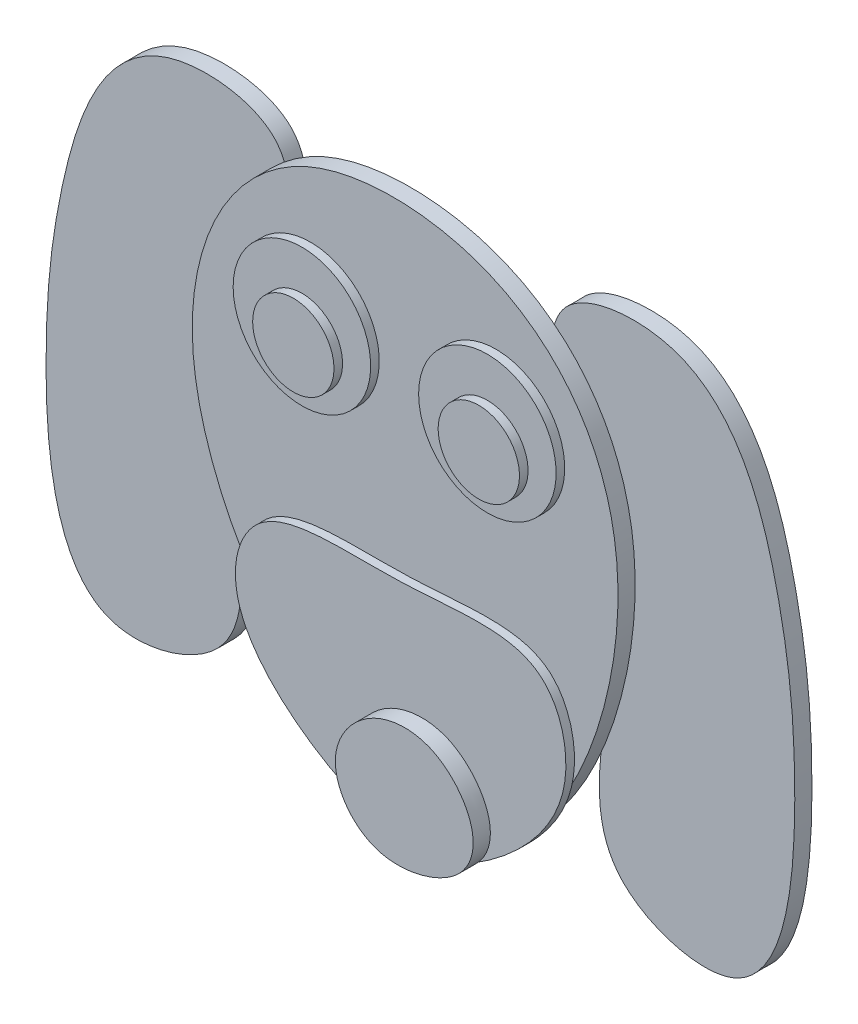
ISO-10303-21;
HEADER;
FILE_DESCRIPTION(('STEP AP214'),'2;1');
FILE_NAME('part.step','',(''),(''),'','','');
FILE_SCHEMA(('AUTOMOTIVE_DESIGN { 1 0 10303 214 1 1 1 1 }'));
ENDSEC;
DATA;
#1=APPLICATION_CONTEXT('core data for automotive mechanical design processes');
#2=APPLICATION_PROTOCOL_DEFINITION('international standard','automotive_design',2000,#1);
#3=PRODUCT_CONTEXT('',#1,'mechanical');
#4=PRODUCT('Part','Part','',(#3));
#5=PRODUCT_RELATED_PRODUCT_CATEGORY('part','',(#4));
#6=PRODUCT_DEFINITION_FORMATION('','',#4);
#7=PRODUCT_DEFINITION_CONTEXT('part definition',#1,'design');
#8=PRODUCT_DEFINITION('design','',#6,#7);
#9=PRODUCT_DEFINITION_SHAPE('','',#8);
#10=(LENGTH_UNIT() NAMED_UNIT(*) SI_UNIT(.MILLI.,.METRE.));
#11=(NAMED_UNIT(*) PLANE_ANGLE_UNIT() SI_UNIT($,.RADIAN.));
#12=(NAMED_UNIT(*) SI_UNIT($,.STERADIAN.) SOLID_ANGLE_UNIT());
#13=UNCERTAINTY_MEASURE_WITH_UNIT(LENGTH_MEASURE(1.E-05),#10,'distance_accuracy_value','');
#14=(GEOMETRIC_REPRESENTATION_CONTEXT(3) GLOBAL_UNCERTAINTY_ASSIGNED_CONTEXT((#13)) GLOBAL_UNIT_ASSIGNED_CONTEXT((#10,
#11,#12)) REPRESENTATION_CONTEXT('',''));
#15=CARTESIAN_POINT('',(0.,0.,0.));
#16=DIRECTION('',(0.,0.,1.));
#17=DIRECTION('',(1.,0.,0.));
#18=AXIS2_PLACEMENT_3D('',#15,#16,#17);
#19=CARTESIAN_POINT('',(9.45131541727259,-39.2016660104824,11.1125));
#20=CARTESIAN_POINT('',(6.01825131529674,-37.8422187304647,11.1125));
#21=CARTESIAN_POINT('',(-2.3819127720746,-38.5803454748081,11.1125));
#22=CARTESIAN_POINT('',(-10.8239151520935,-50.3911620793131,11.1125));
#23=CARTESIAN_POINT('',(-1.64758403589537,-63.4043750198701,11.1125));
#24=CARTESIAN_POINT('',(16.7982250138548,-58.7089776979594,11.1125));
#25=CARTESIAN_POINT('',(19.3055330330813,-47.5745492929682,11.1125));
#26=CARTESIAN_POINT('',(12.8395297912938,-40.5433534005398,11.1125));
#27=CARTESIAN_POINT('',(9.45131541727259,-39.2016660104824,11.1125));
#28=B_SPLINE_CURVE_WITH_KNOTS('',3,(#19,#20,#21,#22,#23,#24,#25,#26,#27),.UNSPECIFIED.,.T.,.F.,
(4,1,1,1,1,1,4),(0.,0.147508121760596,0.304736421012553,0.494752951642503,0.660366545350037,
0.85441893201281,1.),.UNSPECIFIED.);
#29=DIRECTION('',(0.,0.,-1.));
#30=VECTOR('',#29,1.);
#31=SURFACE_OF_LINEAR_EXTRUSION('',#28,#30);
#32=CARTESIAN_POINT('',(9.45131541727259,-39.2016660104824,11.1125));
#33=VERTEX_POINT('',#32);
#34=EDGE_CURVE('E11',#33,#33,#28,.T.);
#35=ORIENTED_EDGE('',*,*,#34,.F.);
#36=EDGE_LOOP('',(#35));
#37=FACE_BOUND('',#36,.T.);
#38=CARTESIAN_POINT('',(9.45131541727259,-39.2016660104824,7.9375));
#39=CARTESIAN_POINT('',(6.01825131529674,-37.8422187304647,7.9375));
#40=CARTESIAN_POINT('',(-2.3819127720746,-38.5803454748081,7.9375));
#41=CARTESIAN_POINT('',(-10.8239151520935,-50.3911620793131,7.9375));
#42=CARTESIAN_POINT('',(-1.64758403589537,-63.4043750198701,7.9375));
#43=CARTESIAN_POINT('',(16.7982250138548,-58.7089776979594,7.9375));
#44=CARTESIAN_POINT('',(19.3055330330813,-47.5745492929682,7.9375));
#45=CARTESIAN_POINT('',(12.8395297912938,-40.5433534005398,7.9375));
#46=CARTESIAN_POINT('',(9.45131541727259,-39.2016660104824,7.9375));
#47=B_SPLINE_CURVE_WITH_KNOTS('',3,(#38,#39,#40,#41,#42,#43,#44,#45,#46),.UNSPECIFIED.,.T.,.F.,
(4,1,1,1,1,1,4),(0.,0.147508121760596,0.304736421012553,0.494752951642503,0.660366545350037,
0.85441893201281,1.),.UNSPECIFIED.);
#48=CARTESIAN_POINT('',(9.45131541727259,-39.2016660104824,7.9375));
#49=VERTEX_POINT('',#48);
#50=EDGE_CURVE('E50',#49,#49,#47,.T.);
#51=ORIENTED_EDGE('',*,*,#50,.T.);
#52=EDGE_LOOP('',(#51));
#53=FACE_BOUND('',#52,.T.);
#54=ADVANCED_FACE('F46',(#37,#53),#31,.F.);
#55=CARTESIAN_POINT('',(0.796373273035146,-60.686504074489,11.1125));
#56=DIRECTION('',(0.,0.,-1.));
#57=DIRECTION('',(-1.,0.,0.));
#58=AXIS2_PLACEMENT_3D('',#55,#56,#57);
#59=PLANE('',#58);
#60=ORIENTED_EDGE('',*,*,#34,.T.);
#61=EDGE_LOOP('',(#60));
#62=FACE_BOUND('',#61,.T.);
#63=ADVANCED_FACE('F69',(#62),#59,.F.);
#64=CARTESIAN_POINT('',(0.796373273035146,-60.686504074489,7.9375));
#65=DIRECTION('',(0.,0.,-1.));
#66=DIRECTION('',(-1.,0.,0.));
#67=AXIS2_PLACEMENT_3D('',#64,#65,#66);
#68=PLANE('',#67);
#69=ORIENTED_EDGE('',*,*,#50,.F.);
#70=EDGE_LOOP('',(#69));
#71=FACE_BOUND('',#70,.T.);
#72=ADVANCED_FACE('F67',(#71),#68,.T.);
#73=CLOSED_SHELL('',(#54,#63,#72));
#74=MANIFOLD_SOLID_BREP('B2',#73);
#75=CARTESIAN_POINT('',(1.73177840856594,-18.5713395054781,7.9375));
#76=CARTESIAN_POINT('',(-8.80254639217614,-18.9796634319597,7.9375));
#77=CARTESIAN_POINT('',(-26.5038469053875,-16.6858401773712,7.9375));
#78=CARTESIAN_POINT('',(-33.5654604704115,-42.6082190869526,7.9375));
#79=CARTESIAN_POINT('',(-0.716408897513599,-63.6561700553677,7.9375));
#80=CARTESIAN_POINT('',(17.397523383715,-56.8159438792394,7.9375));
#81=CARTESIAN_POINT('',(34.7514305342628,-39.5887075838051,7.9375));
#82=CARTESIAN_POINT('',(28.4178877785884,-15.0145616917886,7.9375));
#83=CARTESIAN_POINT('',(11.4267565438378,-18.1955497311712,7.9375));
#84=CARTESIAN_POINT('',(1.73177840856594,-18.5713395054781,7.9375));
#85=B_SPLINE_CURVE_WITH_KNOTS('',3,(#75,#76,#77,#78,#79,#80,#81,#82,#83,#84),.UNSPECIFIED.,.T.,
.F.,(4,1,1,1,1,1,1,4),(0.,0.155426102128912,0.267105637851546,0.464866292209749,
0.593360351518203,0.754333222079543,0.856957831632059,1.),.UNSPECIFIED.);
#86=DIRECTION('',(0.,0.,-1.));
#87=VECTOR('',#86,1.);
#88=SURFACE_OF_LINEAR_EXTRUSION('',#85,#87);
#89=CARTESIAN_POINT('',(1.73177840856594,-18.5713395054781,7.9375));
#90=VERTEX_POINT('',#89);
#91=EDGE_CURVE('E45',#90,#90,#85,.T.);
#92=ORIENTED_EDGE('',*,*,#91,.F.);
#93=EDGE_LOOP('',(#92));
#94=FACE_BOUND('',#93,.T.);
#95=CARTESIAN_POINT('',(1.73177840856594,-18.5713395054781,6.35));
#96=CARTESIAN_POINT('',(-8.80254639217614,-18.9796634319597,6.35));
#97=CARTESIAN_POINT('',(-26.5038469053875,-16.6858401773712,6.35));
#98=CARTESIAN_POINT('',(-33.5654604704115,-42.6082190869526,6.35));
#99=CARTESIAN_POINT('',(-0.716408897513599,-63.6561700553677,6.35));
#100=CARTESIAN_POINT('',(17.397523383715,-56.8159438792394,6.35));
#101=CARTESIAN_POINT('',(34.7514305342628,-39.5887075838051,6.35));
#102=CARTESIAN_POINT('',(28.4178877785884,-15.0145616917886,6.35));
#103=CARTESIAN_POINT('',(11.4267565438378,-18.1955497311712,6.35));
#104=CARTESIAN_POINT('',(1.73177840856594,-18.5713395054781,6.35));
#105=B_SPLINE_CURVE_WITH_KNOTS('',3,(#95,#96,#97,#98,#99,#100,#101,#102,#103,#104),
.UNSPECIFIED.,.T.,.F.,(4,1,1,1,1,1,1,4),(0.,0.155426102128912,0.267105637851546,
0.464866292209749,0.593360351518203,0.754333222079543,0.856957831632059,1.),.UNSPECIFIED.);
#106=CARTESIAN_POINT('',(1.73177840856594,-18.5713395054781,6.35));
#107=VERTEX_POINT('',#106);
#108=EDGE_CURVE('E110',#107,#107,#105,.T.);
#109=ORIENTED_EDGE('',*,*,#108,.T.);
#110=EDGE_LOOP('',(#109));
#111=FACE_BOUND('',#110,.T.);
#112=ADVANCED_FACE('F106',(#94,#111),#88,.F.);
#113=CARTESIAN_POINT('',(5.05122089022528,-59.9636951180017,7.9375));
#114=DIRECTION('',(0.,0.,1.));
#115=DIRECTION('',(1.,0.,0.));
#116=AXIS2_PLACEMENT_3D('',#113,#114,#115);
#117=PLANE('',#116);
#118=ORIENTED_EDGE('',*,*,#91,.T.);
#119=EDGE_LOOP('',(#118));
#120=FACE_BOUND('',#119,.T.);
#121=ADVANCED_FACE('F129',(#120),#117,.T.);
#122=CARTESIAN_POINT('',(5.05122089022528,-59.9636951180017,6.35));
#123=DIRECTION('',(0.,0.,1.));
#124=DIRECTION('',(1.,0.,0.));
#125=AXIS2_PLACEMENT_3D('',#122,#123,#124);
#126=PLANE('',#125);
#127=ORIENTED_EDGE('',*,*,#108,.F.);
#128=EDGE_LOOP('',(#127));
#129=FACE_BOUND('',#128,.T.);
#130=ADVANCED_FACE('F127',(#129),#126,.F.);
#131=CLOSED_SHELL('',(#112,#121,#130));
#132=MANIFOLD_SOLID_BREP('B6',#131);
#133=CARTESIAN_POINT('',(-17.1386901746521,10.957164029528,9.525));
#134=DIRECTION('',(0.,0.,-1.));
#135=DIRECTION('',(-1.,0.,0.));
#136=AXIS2_PLACEMENT_3D('',#133,#134,#135);
#137=CYLINDRICAL_SURFACE('',#136,7.51288946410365);
#138=CARTESIAN_POINT('',(-17.1386901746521,10.957164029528,9.525));
#139=DIRECTION('',(0.,0.,-1.));
#140=DIRECTION('',(-1.,0.,0.));
#141=AXIS2_PLACEMENT_3D('',#138,#139,#140);
#142=CIRCLE('',#141,7.51288946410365);
#143=CARTESIAN_POINT('',(-24.6515796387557,10.957164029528,9.525));
#144=VERTEX_POINT('',#143);
#145=EDGE_CURVE('E170',#144,#144,#142,.T.);
#146=ORIENTED_EDGE('',*,*,#145,.T.);
#147=EDGE_LOOP('',(#146));
#148=FACE_BOUND('',#147,.T.);
#149=CARTESIAN_POINT('',(-17.1386901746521,10.957164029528,7.9375));
#150=DIRECTION('',(0.,0.,-1.));
#151=DIRECTION('',(-1.,0.,0.));
#152=AXIS2_PLACEMENT_3D('',#149,#150,#151);
#153=CIRCLE('',#152,7.51288946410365);
#154=CARTESIAN_POINT('',(-24.6515796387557,10.957164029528,7.9375));
#155=VERTEX_POINT('',#154);
#156=EDGE_CURVE('E105',#155,#155,#153,.T.);
#157=ORIENTED_EDGE('',*,*,#156,.F.);
#158=EDGE_LOOP('',(#157));
#159=FACE_BOUND('',#158,.T.);
#160=ADVANCED_FACE('F166',(#148,#159),#137,.T.);
#161=CARTESIAN_POINT('',(-17.1386901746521,10.957164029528,9.525));
#162=DIRECTION('',(0.,0.,-1.));
#163=DIRECTION('',(-1.,0.,0.));
#164=AXIS2_PLACEMENT_3D('',#161,#162,#163);
#165=PLANE('',#164);
#166=ORIENTED_EDGE('',*,*,#145,.F.);
#167=EDGE_LOOP('',(#166));
#168=FACE_BOUND('',#167,.T.);
#169=ADVANCED_FACE('F168',(#168),#165,.F.);
#170=CARTESIAN_POINT('',(-17.1386901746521,10.957164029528,7.9375));
#171=DIRECTION('',(0.,0.,-1.));
#172=DIRECTION('',(-1.,0.,0.));
#173=AXIS2_PLACEMENT_3D('',#170,#171,#172);
#174=PLANE('',#173);
#175=ORIENTED_EDGE('',*,*,#156,.T.);
#176=EDGE_LOOP('',(#175));
#177=FACE_BOUND('',#176,.T.);
#178=ADVANCED_FACE('F182',(#177),#174,.T.);
#179=CLOSED_SHELL('',(#160,#169,#178));
#180=MANIFOLD_SOLID_BREP('B40',#179);
#181=CARTESIAN_POINT('',(17.1386901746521,10.957164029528,9.525));
#182=DIRECTION('',(0.,0.,-1.));
#183=DIRECTION('',(-1.,0.,0.));
#184=AXIS2_PLACEMENT_3D('',#181,#182,#183);
#185=CYLINDRICAL_SURFACE('',#184,7.51288946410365);
#186=CARTESIAN_POINT('',(17.1386901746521,10.957164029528,9.525));
#187=DIRECTION('',(0.,0.,-1.));
#188=DIRECTION('',(-1.,0.,0.));
#189=AXIS2_PLACEMENT_3D('',#186,#187,#188);
#190=CIRCLE('',#189,7.51288946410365);
#191=CARTESIAN_POINT('',(9.62580071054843,10.957164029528,9.525));
#192=VERTEX_POINT('',#191);
#193=EDGE_CURVE('E165',#192,#192,#190,.T.);
#194=ORIENTED_EDGE('',*,*,#193,.T.);
#195=EDGE_LOOP('',(#194));
#196=FACE_BOUND('',#195,.T.);
#197=CARTESIAN_POINT('',(17.1386901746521,10.957164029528,7.9375));
#198=DIRECTION('',(0.,0.,-1.));
#199=DIRECTION('',(-1.,0.,0.));
#200=AXIS2_PLACEMENT_3D('',#197,#198,#199);
#201=CIRCLE('',#200,7.51288946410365);
#202=CARTESIAN_POINT('',(9.62580071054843,10.957164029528,7.9375));
#203=VERTEX_POINT('',#202);
#204=EDGE_CURVE('E218',#203,#203,#201,.T.);
#205=ORIENTED_EDGE('',*,*,#204,.F.);
#206=EDGE_LOOP('',(#205));
#207=FACE_BOUND('',#206,.T.);
#208=ADVANCED_FACE('F215',(#196,#207),#185,.T.);
#209=CARTESIAN_POINT('',(17.1386901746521,10.957164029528,9.525));
#210=DIRECTION('',(0.,0.,-1.));
#211=DIRECTION('',(-1.,0.,0.));
#212=AXIS2_PLACEMENT_3D('',#209,#210,#211);
#213=PLANE('',#212);
#214=ORIENTED_EDGE('',*,*,#193,.F.);
#215=EDGE_LOOP('',(#214));
#216=FACE_BOUND('',#215,.T.);
#217=ADVANCED_FACE('F230',(#216),#213,.F.);
#218=CARTESIAN_POINT('',(17.1386901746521,10.957164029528,7.9375));
#219=DIRECTION('',(0.,0.,-1.));
#220=DIRECTION('',(-1.,0.,0.));
#221=AXIS2_PLACEMENT_3D('',#218,#219,#220);
#222=PLANE('',#221);
#223=ORIENTED_EDGE('',*,*,#204,.T.);
#224=EDGE_LOOP('',(#223));
#225=FACE_BOUND('',#224,.T.);
#226=ADVANCED_FACE('F227',(#225),#222,.T.);
#227=CLOSED_SHELL('',(#208,#217,#226));
#228=MANIFOLD_SOLID_BREP('B100',#227);
#229=CARTESIAN_POINT('',(17.1386901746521,13.144413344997,7.9375));
#230=DIRECTION('',(0.,0.,-1.));
#231=DIRECTION('',(-1.,0.,0.));
#232=AXIS2_PLACEMENT_3D('',#229,#230,#231);
#233=CYLINDRICAL_SURFACE('',#232,12.7077606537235);
#234=CARTESIAN_POINT('',(17.1386901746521,13.144413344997,7.9375));
#235=DIRECTION('',(0.,0.,-1.));
#236=DIRECTION('',(-1.,0.,0.));
#237=AXIS2_PLACEMENT_3D('',#234,#235,#236);
#238=CIRCLE('',#237,12.7077606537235);
#239=CARTESIAN_POINT('',(4.43092952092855,13.144413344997,7.9375));
#240=VERTEX_POINT('',#239);
#241=EDGE_CURVE('E268',#240,#240,#238,.T.);
#242=ORIENTED_EDGE('',*,*,#241,.T.);
#243=EDGE_LOOP('',(#242));
#244=FACE_BOUND('',#243,.T.);
#245=CARTESIAN_POINT('',(17.1386901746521,13.144413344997,6.35));
#246=DIRECTION('',(0.,0.,-1.));
#247=DIRECTION('',(-1.,0.,0.));
#248=AXIS2_PLACEMENT_3D('',#245,#246,#247);
#249=CIRCLE('',#248,12.7077606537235);
#250=CARTESIAN_POINT('',(4.43092952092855,13.144413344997,6.35));
#251=VERTEX_POINT('',#250);
#252=EDGE_CURVE('E214',#251,#251,#249,.T.);
#253=ORIENTED_EDGE('',*,*,#252,.F.);
#254=EDGE_LOOP('',(#253));
#255=FACE_BOUND('',#254,.T.);
#256=ADVANCED_FACE('F264',(#244,#255),#233,.T.);
#257=CARTESIAN_POINT('',(17.1386901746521,13.144413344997,7.9375));
#258=DIRECTION('',(0.,0.,-1.));
#259=DIRECTION('',(-1.,0.,0.));
#260=AXIS2_PLACEMENT_3D('',#257,#258,#259);
#261=PLANE('',#260);
#262=ORIENTED_EDGE('',*,*,#241,.F.);
#263=EDGE_LOOP('',(#262));
#264=FACE_BOUND('',#263,.T.);
#265=ADVANCED_FACE('F266',(#264),#261,.F.);
#266=CARTESIAN_POINT('',(17.1386901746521,13.144413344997,6.35));
#267=DIRECTION('',(0.,0.,-1.));
#268=DIRECTION('',(-1.,0.,0.));
#269=AXIS2_PLACEMENT_3D('',#266,#267,#268);
#270=PLANE('',#269);
#271=ORIENTED_EDGE('',*,*,#252,.T.);
#272=EDGE_LOOP('',(#271));
#273=FACE_BOUND('',#272,.T.);
#274=ADVANCED_FACE('F280',(#273),#270,.T.);
#275=CLOSED_SHELL('',(#256,#265,#274));
#276=MANIFOLD_SOLID_BREP('B160',#275);
#277=CARTESIAN_POINT('',(-17.1386901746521,13.144413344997,7.9375));
#278=DIRECTION('',(0.,0.,-1.));
#279=DIRECTION('',(-1.,0.,0.));
#280=AXIS2_PLACEMENT_3D('',#277,#278,#279);
#281=CYLINDRICAL_SURFACE('',#280,12.7077606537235);
#282=CARTESIAN_POINT('',(-17.1386901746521,13.144413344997,7.9375));
#283=DIRECTION('',(0.,0.,-1.));
#284=DIRECTION('',(-1.,0.,0.));
#285=AXIS2_PLACEMENT_3D('',#282,#283,#284);
#286=CIRCLE('',#285,12.7077606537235);
#287=CARTESIAN_POINT('',(-29.8464508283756,13.144413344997,7.9375));
#288=VERTEX_POINT('',#287);
#289=EDGE_CURVE('E263',#288,#288,#286,.T.);
#290=ORIENTED_EDGE('',*,*,#289,.T.);
#291=EDGE_LOOP('',(#290));
#292=FACE_BOUND('',#291,.T.);
#293=CARTESIAN_POINT('',(-17.1386901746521,13.144413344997,6.35));
#294=DIRECTION('',(0.,0.,-1.));
#295=DIRECTION('',(-1.,0.,0.));
#296=AXIS2_PLACEMENT_3D('',#293,#294,#295);
#297=CIRCLE('',#296,12.7077606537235);
#298=CARTESIAN_POINT('',(-29.8464508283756,13.144413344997,6.35));
#299=VERTEX_POINT('',#298);
#300=EDGE_CURVE('E316',#299,#299,#297,.T.);
#301=ORIENTED_EDGE('',*,*,#300,.F.);
#302=EDGE_LOOP('',(#301));
#303=FACE_BOUND('',#302,.T.);
#304=ADVANCED_FACE('F313',(#292,#303),#281,.T.);
#305=CARTESIAN_POINT('',(-17.1386901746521,13.144413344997,7.9375));
#306=DIRECTION('',(0.,0.,-1.));
#307=DIRECTION('',(-1.,0.,0.));
#308=AXIS2_PLACEMENT_3D('',#305,#306,#307);
#309=PLANE('',#308);
#310=ORIENTED_EDGE('',*,*,#289,.F.);
#311=EDGE_LOOP('',(#310));
#312=FACE_BOUND('',#311,.T.);
#313=ADVANCED_FACE('F328',(#312),#309,.F.);
#314=CARTESIAN_POINT('',(-17.1386901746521,13.144413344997,6.35));
#315=DIRECTION('',(0.,0.,-1.));
#316=DIRECTION('',(-1.,0.,0.));
#317=AXIS2_PLACEMENT_3D('',#314,#315,#316);
#318=PLANE('',#317);
#319=ORIENTED_EDGE('',*,*,#300,.T.);
#320=EDGE_LOOP('',(#319));
#321=FACE_BOUND('',#320,.T.);
#322=ADVANCED_FACE('F325',(#321),#318,.T.);
#323=CLOSED_SHELL('',(#304,#313,#322));
#324=MANIFOLD_SOLID_BREP('B209',#323);
#325=CARTESIAN_POINT('',(27.5950972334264,36.558889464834,0.));
#326=CARTESIAN_POINT('',(31.5891549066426,40.02395199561,0.));
#327=CARTESIAN_POINT('',(56.5387784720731,42.8033917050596,0.));
#328=CARTESIAN_POINT('',(67.0279603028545,10.3676564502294,0.));
#329=CARTESIAN_POINT('',(70.2512790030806,-20.0895193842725,0.));
#330=CARTESIAN_POINT('',(67.3505577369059,-62.9410835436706,0.));
#331=CARTESIAN_POINT('',(29.9048832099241,-52.1293042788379,0.));
#332=CARTESIAN_POINT('',(34.3878160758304,-26.418365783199,0.));
#333=CARTESIAN_POINT('',(38.0796431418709,9.70879907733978,0.));
#334=CARTESIAN_POINT('',(21.8619742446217,22.3664918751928,0.));
#335=CARTESIAN_POINT('',(25.0611926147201,34.360589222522,0.));
#336=CARTESIAN_POINT('',(27.5950972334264,36.558889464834,0.));
#337=B_SPLINE_CURVE_WITH_KNOTS('',3,(#325,#326,#327,#328,#329,#330,#331,#332,#333,#334,#335,
#336),.UNSPECIFIED.,.T.,.F.,(4,1,1,1,1,1,1,1,1,4),(0.,0.0766597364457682,0.234655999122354,
0.351216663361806,0.51040969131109,0.600219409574,0.722886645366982,0.819262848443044,
0.951365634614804,1.),.UNSPECIFIED.);
#338=DIRECTION('',(0.,0.,1.));
#339=VECTOR('',#338,1.);
#340=SURFACE_OF_LINEAR_EXTRUSION('',#337,#339);
#341=CARTESIAN_POINT('',(27.5950972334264,36.558889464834,0.));
#342=VERTEX_POINT('',#341);
#343=EDGE_CURVE('E366',#342,#342,#337,.T.);
#344=ORIENTED_EDGE('',*,*,#343,.F.);
#345=EDGE_LOOP('',(#344));
#346=FACE_BOUND('',#345,.T.);
#347=CARTESIAN_POINT('',(27.5950972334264,36.558889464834,3.175));
#348=CARTESIAN_POINT('',(31.5891549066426,40.02395199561,3.175));
#349=CARTESIAN_POINT('',(56.5387784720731,42.8033917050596,3.175));
#350=CARTESIAN_POINT('',(67.0279603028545,10.3676564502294,3.175));
#351=CARTESIAN_POINT('',(70.2512790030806,-20.0895193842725,3.175));
#352=CARTESIAN_POINT('',(67.3505577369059,-62.9410835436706,3.175));
#353=CARTESIAN_POINT('',(29.9048832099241,-52.1293042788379,3.175));
#354=CARTESIAN_POINT('',(34.3878160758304,-26.418365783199,3.175));
#355=CARTESIAN_POINT('',(38.0796431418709,9.70879907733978,3.175));
#356=CARTESIAN_POINT('',(21.8619742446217,22.3664918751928,3.175));
#357=CARTESIAN_POINT('',(25.0611926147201,34.360589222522,3.175));
#358=CARTESIAN_POINT('',(27.5950972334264,36.558889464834,3.175));
#359=B_SPLINE_CURVE_WITH_KNOTS('',3,(#347,#348,#349,#350,#351,#352,#353,#354,#355,#356,#357,
#358),.UNSPECIFIED.,.T.,.F.,(4,1,1,1,1,1,1,1,1,4),(0.,0.0766597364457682,0.234655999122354,
0.351216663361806,0.51040969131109,0.600219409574,0.722886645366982,0.819262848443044,
0.951365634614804,1.),.UNSPECIFIED.);
#360=CARTESIAN_POINT('',(27.5950972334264,36.558889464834,3.175));
#361=VERTEX_POINT('',#360);
#362=EDGE_CURVE('E312',#361,#361,#359,.T.);
#363=ORIENTED_EDGE('',*,*,#362,.T.);
#364=EDGE_LOOP('',(#363));
#365=FACE_BOUND('',#364,.T.);
#366=ADVANCED_FACE('F362',(#346,#365),#340,.F.);
#367=CARTESIAN_POINT('',(59.335674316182,-55.2582217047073,0.));
#368=DIRECTION('',(0.,0.,1.));
#369=DIRECTION('',(1.,0.,0.));
#370=AXIS2_PLACEMENT_3D('',#367,#368,#369);
#371=PLANE('',#370);
#372=ORIENTED_EDGE('',*,*,#343,.T.);
#373=EDGE_LOOP('',(#372));
#374=FACE_BOUND('',#373,.T.);
#375=ADVANCED_FACE('F364',(#374),#371,.F.);
#376=CARTESIAN_POINT('',(59.335674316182,-55.2582217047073,3.175));
#377=DIRECTION('',(0.,0.,1.));
#378=DIRECTION('',(1.,0.,0.));
#379=AXIS2_PLACEMENT_3D('',#376,#377,#378);
#380=PLANE('',#379);
#381=ORIENTED_EDGE('',*,*,#362,.F.);
#382=EDGE_LOOP('',(#381));
#383=FACE_BOUND('',#382,.T.);
#384=ADVANCED_FACE('F389',(#383),#380,.T.);
#385=CLOSED_SHELL('',(#366,#375,#384));
#386=MANIFOLD_SOLID_BREP('B258',#385);
#387=CARTESIAN_POINT('',(-27.5950972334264,36.5588894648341,0.));
#388=CARTESIAN_POINT('',(-31.5891549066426,40.02395199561,0.));
#389=CARTESIAN_POINT('',(-56.5387784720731,42.8033917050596,0.));
#390=CARTESIAN_POINT('',(-67.0279603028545,10.3676564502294,0.));
#391=CARTESIAN_POINT('',(-70.2512790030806,-20.0895193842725,0.));
#392=CARTESIAN_POINT('',(-67.3505577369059,-62.9410835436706,0.));
#393=CARTESIAN_POINT('',(-29.9048832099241,-52.1293042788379,0.));
#394=CARTESIAN_POINT('',(-34.3878160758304,-26.418365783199,0.));
#395=CARTESIAN_POINT('',(-38.0796431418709,9.70879907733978,0.));
#396=CARTESIAN_POINT('',(-21.8619742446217,22.3664918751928,0.));
#397=CARTESIAN_POINT('',(-25.0611926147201,34.360589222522,0.));
#398=CARTESIAN_POINT('',(-27.5950972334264,36.5588894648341,0.));
#399=B_SPLINE_CURVE_WITH_KNOTS('',3,(#387,#388,#389,#390,#391,#392,#393,#394,#395,#396,#397,
#398),.UNSPECIFIED.,.T.,.F.,(4,1,1,1,1,1,1,1,1,4),(0.,0.0766597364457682,0.234655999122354,
0.351216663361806,0.51040969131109,0.600219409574,0.722886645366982,0.819262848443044,
0.951365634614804,1.),.UNSPECIFIED.);
#400=DIRECTION('',(0.,0.,1.));
#401=VECTOR('',#400,1.);
#402=SURFACE_OF_LINEAR_EXTRUSION('',#399,#401);
#403=CARTESIAN_POINT('',(-27.5950972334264,36.5588894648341,0.));
#404=VERTEX_POINT('',#403);
#405=EDGE_CURVE('E361',#404,#404,#399,.T.);
#406=ORIENTED_EDGE('',*,*,#405,.T.);
#407=EDGE_LOOP('',(#406));
#408=FACE_BOUND('',#407,.T.);
#409=CARTESIAN_POINT('',(-27.5950972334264,36.5588894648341,3.175));
#410=CARTESIAN_POINT('',(-31.5891549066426,40.02395199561,3.175));
#411=CARTESIAN_POINT('',(-56.5387784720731,42.8033917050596,3.175));
#412=CARTESIAN_POINT('',(-67.0279603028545,10.3676564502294,3.175));
#413=CARTESIAN_POINT('',(-70.2512790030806,-20.0895193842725,3.175));
#414=CARTESIAN_POINT('',(-67.3505577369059,-62.9410835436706,3.175));
#415=CARTESIAN_POINT('',(-29.9048832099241,-52.1293042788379,3.175));
#416=CARTESIAN_POINT('',(-34.3878160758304,-26.418365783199,3.175));
#417=CARTESIAN_POINT('',(-38.0796431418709,9.70879907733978,3.175));
#418=CARTESIAN_POINT('',(-21.8619742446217,22.3664918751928,3.175));
#419=CARTESIAN_POINT('',(-25.0611926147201,34.360589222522,3.175));
#420=CARTESIAN_POINT('',(-27.5950972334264,36.5588894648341,3.175));
#421=B_SPLINE_CURVE_WITH_KNOTS('',3,(#409,#410,#411,#412,#413,#414,#415,#416,#417,#418,#419,
#420),.UNSPECIFIED.,.T.,.F.,(4,1,1,1,1,1,1,1,1,4),(0.,0.0766597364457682,0.234655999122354,
0.351216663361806,0.51040969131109,0.600219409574,0.722886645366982,0.819262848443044,
0.951365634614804,1.),.UNSPECIFIED.);
#422=CARTESIAN_POINT('',(-27.5950972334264,36.5588894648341,3.175));
#423=VERTEX_POINT('',#422);
#424=EDGE_CURVE('E440',#423,#423,#421,.T.);
#425=ORIENTED_EDGE('',*,*,#424,.F.);
#426=EDGE_LOOP('',(#425));
#427=FACE_BOUND('',#426,.T.);
#428=ADVANCED_FACE('F436',(#408,#427),#402,.T.);
#429=CARTESIAN_POINT('',(-59.335674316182,-55.2582217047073,0.));
#430=DIRECTION('',(0.,0.,-1.));
#431=DIRECTION('',(-1.,0.,0.));
#432=AXIS2_PLACEMENT_3D('',#429,#430,#431);
#433=PLANE('',#432);
#434=ORIENTED_EDGE('',*,*,#405,.F.);
#435=EDGE_LOOP('',(#434));
#436=FACE_BOUND('',#435,.T.);
#437=ADVANCED_FACE('F459',(#436),#433,.T.);
#438=CARTESIAN_POINT('',(-59.335674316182,-55.2582217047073,3.175));
#439=DIRECTION('',(0.,0.,-1.));
#440=DIRECTION('',(-1.,0.,0.));
#441=AXIS2_PLACEMENT_3D('',#438,#439,#440);
#442=PLANE('',#441);
#443=ORIENTED_EDGE('',*,*,#424,.T.);
#444=EDGE_LOOP('',(#443));
#445=FACE_BOUND('',#444,.T.);
#446=ADVANCED_FACE('F456',(#445),#442,.F.);
#447=CLOSED_SHELL('',(#428,#437,#446));
#448=MANIFOLD_SOLID_BREP('B307',#447);
#449=CARTESIAN_POINT('',(0.,0.,3.175));
#450=DIRECTION('',(0.,0.,-1.));
#451=DIRECTION('',(-1.,0.,0.));
#452=AXIS2_PLACEMENT_3D('',#449,#450,#451);
#453=CYLINDRICAL_SURFACE('',#452,25.4);
#454=CARTESIAN_POINT('',(0.,0.,3.175));
#455=DIRECTION('',(0.,0.,1.));
#456=DIRECTION('',(1.,0.,0.));
#457=AXIS2_PLACEMENT_3D('',#454,#455,#456);
#458=CIRCLE('',#457,25.4);
#459=CARTESIAN_POINT('',(25.4,0.,3.175));
#460=VERTEX_POINT('',#459);
#461=EDGE_CURVE('E435',#460,#460,#458,.T.);
#462=ORIENTED_EDGE('',*,*,#461,.F.);
#463=EDGE_LOOP('',(#462));
#464=FACE_BOUND('',#463,.T.);
#465=CARTESIAN_POINT('',(0.,0.,0.));
#466=DIRECTION('',(0.,0.,1.));
#467=DIRECTION('',(1.,0.,0.));
#468=AXIS2_PLACEMENT_3D('',#465,#466,#467);
#469=CIRCLE('',#468,25.4);
#470=CARTESIAN_POINT('',(25.4,0.,0.));
#471=VERTEX_POINT('',#470);
#472=EDGE_CURVE('E506',#471,#471,#469,.T.);
#473=ORIENTED_EDGE('',*,*,#472,.T.);
#474=EDGE_LOOP('',(#473));
#475=FACE_BOUND('',#474,.T.);
#476=ADVANCED_FACE('F503',(#464,#475),#453,.T.);
#477=CARTESIAN_POINT('',(0.,0.,0.));
#478=DIRECTION('',(0.,0.,1.));
#479=DIRECTION('',(1.,0.,0.));
#480=AXIS2_PLACEMENT_3D('',#477,#478,#479);
#481=PLANE('',#480);
#482=ORIENTED_EDGE('',*,*,#472,.F.);
#483=EDGE_LOOP('',(#482));
#484=FACE_BOUND('',#483,.T.);
#485=ADVANCED_FACE('F535',(#484),#481,.F.);
#486=CARTESIAN_POINT('',(10.467378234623,39.1060951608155,6.35));
#487=CARTESIAN_POINT('',(1.65554748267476,41.4706186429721,6.35));
#488=CARTESIAN_POINT('',(-28.1661814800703,41.1084114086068,6.35));
#489=CARTESIAN_POINT('',(-50.7121524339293,-7.12036124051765,6.35));
#490=CARTESIAN_POINT('',(-10.592979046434,-61.0565383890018,6.35));
#491=CARTESIAN_POINT('',(29.8350088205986,-52.44491033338,6.35));
#492=CARTESIAN_POINT('',(49.078275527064,8.56379246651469,6.35));
#493=CARTESIAN_POINT('',(26.1790622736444,34.8900988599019,6.35));
#494=CARTESIAN_POINT('',(10.467378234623,39.1060951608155,6.35));
#495=B_SPLINE_CURVE_WITH_KNOTS('',3,(#486,#487,#488,#489,#490,#491,#492,#493,#494),
.UNSPECIFIED.,.T.,.F.,(4,1,1,1,1,1,4),(0.,0.101862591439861,0.291151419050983,0.50932015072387,
0.606012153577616,0.818376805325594,1.),.UNSPECIFIED.);
#496=DIRECTION('',(0.,0.,-1.));
#497=VECTOR('',#496,1.);
#498=SURFACE_OF_LINEAR_EXTRUSION('',#495,#497);
#499=CARTESIAN_POINT('',(10.467378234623,39.1060951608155,6.35));
#500=VERTEX_POINT('',#499);
#501=EDGE_CURVE('E513',#500,#500,#495,.T.);
#502=ORIENTED_EDGE('',*,*,#501,.F.);
#503=EDGE_LOOP('',(#502));
#504=FACE_BOUND('',#503,.T.);
#505=CARTESIAN_POINT('',(10.467378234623,39.1060951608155,3.175));
#506=CARTESIAN_POINT('',(1.65554748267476,41.4706186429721,3.175));
#507=CARTESIAN_POINT('',(-28.1661814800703,41.1084114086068,3.175));
#508=CARTESIAN_POINT('',(-50.7121524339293,-7.12036124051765,3.175));
#509=CARTESIAN_POINT('',(-10.592979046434,-61.0565383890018,3.175));
#510=CARTESIAN_POINT('',(29.8350088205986,-52.44491033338,3.175));
#511=CARTESIAN_POINT('',(49.078275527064,8.56379246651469,3.175));
#512=CARTESIAN_POINT('',(26.1790622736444,34.8900988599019,3.175));
#513=CARTESIAN_POINT('',(10.467378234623,39.1060951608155,3.175));
#514=B_SPLINE_CURVE_WITH_KNOTS('',3,(#505,#506,#507,#508,#509,#510,#511,#512,#513),
.UNSPECIFIED.,.T.,.F.,(4,1,1,1,1,1,4),(0.,0.101862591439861,0.291151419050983,0.50932015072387,
0.606012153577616,0.818376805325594,1.),.UNSPECIFIED.);
#515=CARTESIAN_POINT('',(10.467378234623,39.1060951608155,3.175));
#516=VERTEX_POINT('',#515);
#517=EDGE_CURVE('E515',#516,#516,#514,.T.);
#518=ORIENTED_EDGE('',*,*,#517,.T.);
#519=EDGE_LOOP('',(#518));
#520=FACE_BOUND('',#519,.T.);
#521=ADVANCED_FACE('F531',(#504,#520),#498,.F.);
#522=CARTESIAN_POINT('',(-3.5342331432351,-54.7079201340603,6.35));
#523=DIRECTION('',(0.,0.,-1.));
#524=DIRECTION('',(-1.,0.,0.));
#525=AXIS2_PLACEMENT_3D('',#522,#523,#524);
#526=PLANE('',#525);
#527=ORIENTED_EDGE('',*,*,#501,.T.);
#528=EDGE_LOOP('',(#527));
#529=FACE_BOUND('',#528,.T.);
#530=ADVANCED_FACE('F534',(#529),#526,.F.);
#531=CARTESIAN_POINT('',(-3.5342331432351,-54.7079201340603,3.175));
#532=DIRECTION('',(0.,0.,-1.));
#533=DIRECTION('',(-1.,0.,0.));
#534=AXIS2_PLACEMENT_3D('',#531,#532,#533);
#535=PLANE('',#534);
#536=ORIENTED_EDGE('',*,*,#461,.T.);
#537=EDGE_LOOP('',(#536));
#538=FACE_BOUND('',#537,.T.);
#539=ORIENTED_EDGE('',*,*,#517,.F.);
#540=EDGE_LOOP('',(#539));
#541=FACE_BOUND('',#540,.T.);
#542=ADVANCED_FACE('F537',(#538,#541),#535,.T.);
#543=CLOSED_SHELL('',(#476,#485,#521,#530,#542));
#544=MANIFOLD_SOLID_BREP('B356',#543);
#545=ADVANCED_BREP_SHAPE_REPRESENTATION('',(#18,#74,#132,#180,#228,#276,#324,#386,#448,#544),#14);
#546=SHAPE_DEFINITION_REPRESENTATION(#9,#545);
ENDSEC;
END-ISO-10303-21;
